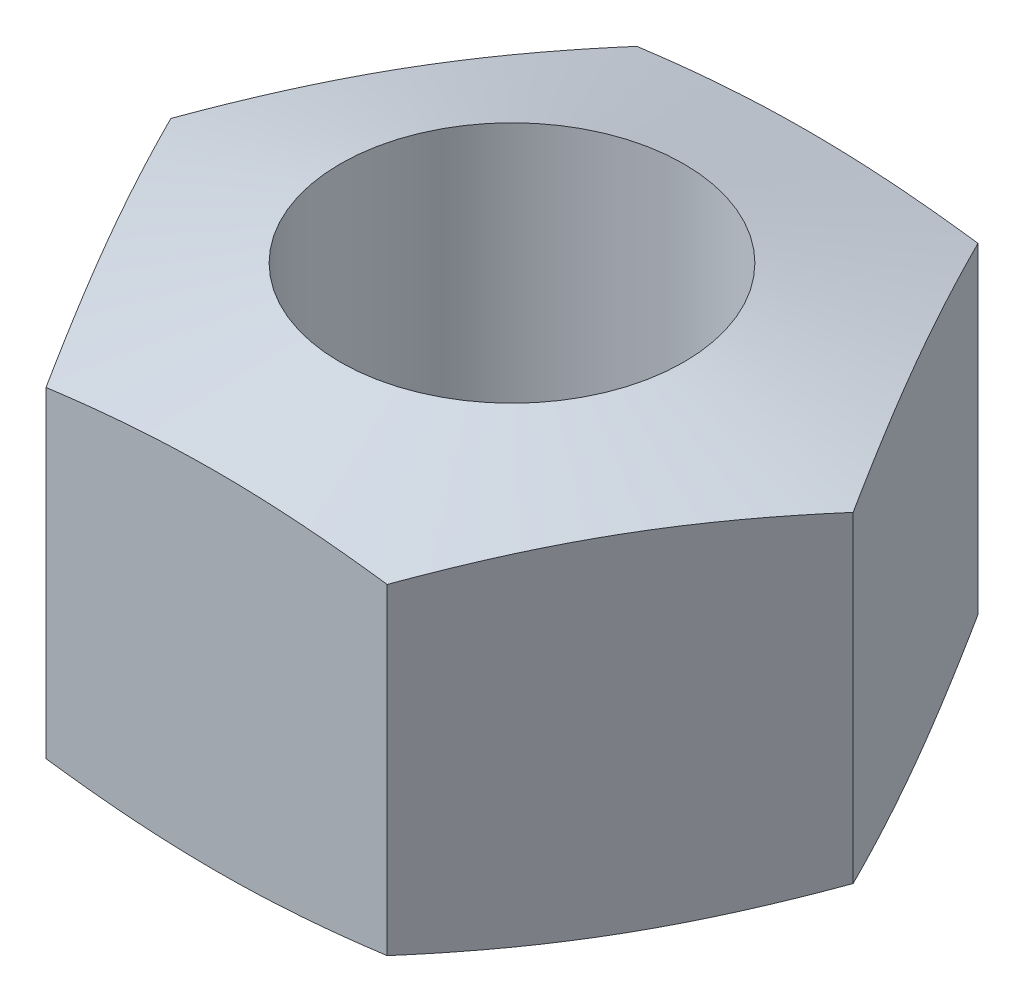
from build123d import *

# Parameters (mm, degrees)
BOSS_EXTRUDE1_DEPTH     = 1.5
SKETCH2_OUTSIDE_W       = 30.802
SKETCH2_OUTSIDE_H       = 30.136
SKETCH2_OUTSIDE_R       = 1.25
CUT_EXTRUDE1_DEPTH      = 3
CUT_EXTRUDE1_DRAFT      = -75
MIRROR1_COPY_1_SKETCH_W = 30.802
MIRROR1_COPY_1_SKETCH_H = 30.136
MIRROR1_COPY_1_SKETCH_R = 1.25
MIRROR1_COPY_1_DEPTH    = 3
MIRROR1_COPY_1_DRAFT    = -75
SKETCH3_R               = 1.25
CUT_EXTRUDE2_DEPTH      = 3


with BuildPart() as part:
    # Sketch1 → Boss-Extrude1 (new, symmetric)
    with BuildSketch(Plane(origin=(0, 0, 0), x_dir=(1, 0, 0), z_dir=(0, 1, 0))):
        Polygon((2.482606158, 0), (1.241303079, 2.15), (-1.241303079, 2.15), (-2.482606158, 0), (-1.241303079, -2.15), (1.241303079, -2.15), align=None)
    extrude(amount=BOSS_EXTRUDE1_DEPTH, both=True)


with BuildPart() as cut_extrude1_tool:
    # Sketch2 outside → Cut-Extrude1 (with draft: the straight prism first)
    with BuildSketch(Plane(origin=(0, 1.5, 0), x_dir=(1, 0, 0), z_dir=(0, 1, 0))):
        Rectangle(SKETCH2_OUTSIDE_W, SKETCH2_OUTSIDE_H)
        Circle(SKETCH2_OUTSIDE_R, mode=Mode.SUBTRACT)
    extrude(amount=-CUT_EXTRUDE1_DEPTH)
    # Cut-Extrude1: the draft: its side faces are tilted about the plane it starts from
    cut_extrude1_sides = [cut_extrude1_tool.faces().sort_by_distance(p)[0] for p in [
        (0, 0, 15.068),
        (15.401, 0, 0),
        (0, 0, -15.068),
        (-15.401, 0, 0),
        (-1.25, 0, 0),
    ]]
    draft(cut_extrude1_sides, Plane(origin=(0, 1.5, 0), x_dir=(1, 0, 0), z_dir=(0, 1, 0)), CUT_EXTRUDE1_DRAFT)


with BuildPart() as part_1:
    add(part.part)

    # Cut-Extrude1: cut by cut_extrude1_tool
    add(cut_extrude1_tool.part, mode=Mode.SUBTRACT)


with BuildPart() as mirror1_copy_1_tool:
    # Mirror1 copy 1 sketch → Mirror1 copy 1 (with draft: the straight prism first)
    with BuildSketch(Plane.XZ.offset(1.5)):
        Rectangle(MIRROR1_COPY_1_SKETCH_W, MIRROR1_COPY_1_SKETCH_H)
        Circle(MIRROR1_COPY_1_SKETCH_R, mode=Mode.SUBTRACT)
    extrude(amount=-MIRROR1_COPY_1_DEPTH)
    # Mirror1 copy 1: the draft: its side faces are tilted about the plane it starts from
    mirror1_copy_1_sides = [mirror1_copy_1_tool.faces().sort_by_distance(p)[0] for p in [
        (0, 0, 15.068),
        (15.401, 0, 0),
        (0, 0, -15.068),
        (-15.401, 0, 0),
        (-1.25, 0, 0),
    ]]
    draft(mirror1_copy_1_sides, Plane.XZ.offset(1.5), MIRROR1_COPY_1_DRAFT)


with BuildPart() as part_2:
    add(part_1.part)

    # Mirror1 copy 1: cut by mirror1_copy_1_tool
    add(mirror1_copy_1_tool.part, mode=Mode.SUBTRACT)

    # Sketch3 → Cut-Extrude2 (cut)
    with BuildSketch(Plane(origin=(0, 1.5, 0), x_dir=(1, 0, 0), z_dir=(0, 1, 0))):
        with Locations(Location((0, 0, 0), (0, 0, 270))):
            Circle(SKETCH3_R)
    extrude(amount=-CUT_EXTRUDE2_DEPTH, mode=Mode.SUBTRACT)


solid = part_2.part
